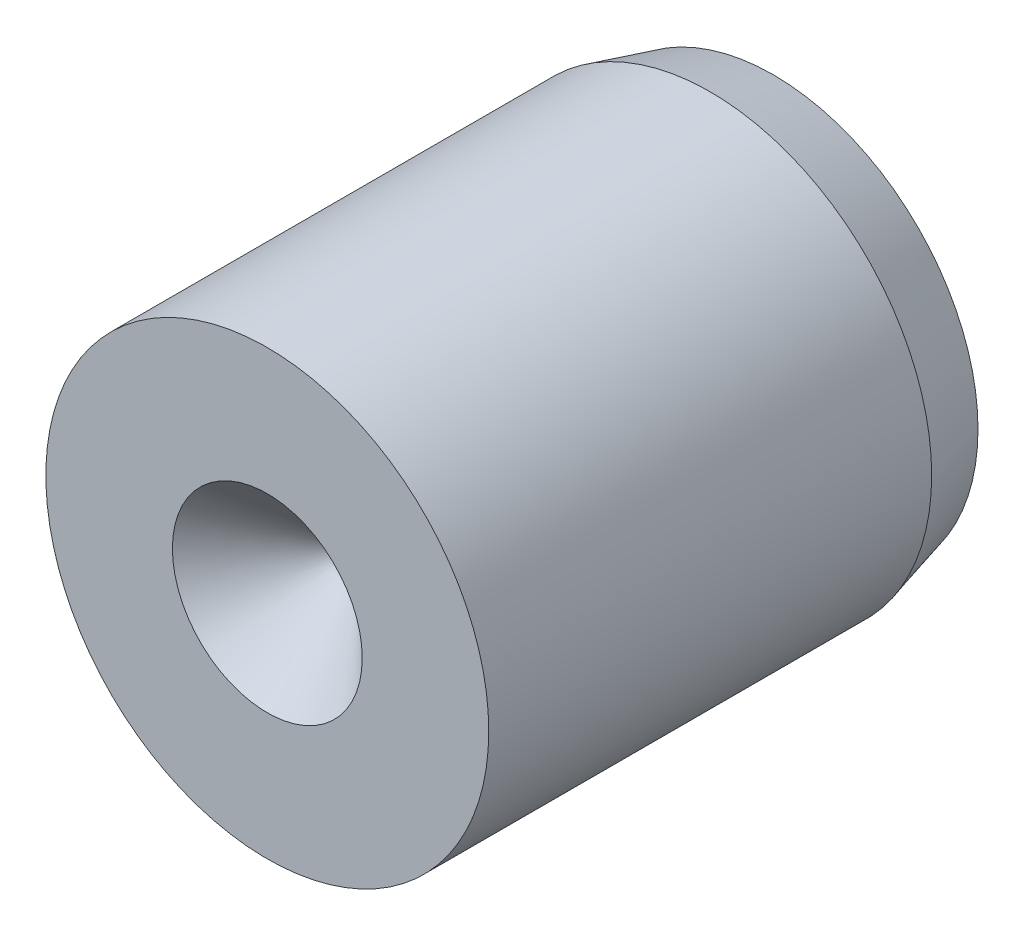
ISO-10303-21;
HEADER;
FILE_DESCRIPTION(('STEP AP214'),'2;1');
FILE_NAME('part.step','',(''),(''),'','','');
FILE_SCHEMA(('AUTOMOTIVE_DESIGN { 1 0 10303 214 1 1 1 1 }'));
ENDSEC;
DATA;
#1=APPLICATION_CONTEXT('core data for automotive mechanical design processes');
#2=APPLICATION_PROTOCOL_DEFINITION('international standard','automotive_design',2000,#1);
#3=PRODUCT_CONTEXT('',#1,'mechanical');
#4=PRODUCT('Part','Part','',(#3));
#5=PRODUCT_RELATED_PRODUCT_CATEGORY('part','',(#4));
#6=PRODUCT_DEFINITION_FORMATION('','',#4);
#7=PRODUCT_DEFINITION_CONTEXT('part definition',#1,'design');
#8=PRODUCT_DEFINITION('design','',#6,#7);
#9=PRODUCT_DEFINITION_SHAPE('','',#8);
#10=(LENGTH_UNIT() NAMED_UNIT(*) SI_UNIT(.MILLI.,.METRE.));
#11=(NAMED_UNIT(*) PLANE_ANGLE_UNIT() SI_UNIT($,.RADIAN.));
#12=(NAMED_UNIT(*) SI_UNIT($,.STERADIAN.) SOLID_ANGLE_UNIT());
#13=UNCERTAINTY_MEASURE_WITH_UNIT(LENGTH_MEASURE(1.E-05),#10,'distance_accuracy_value','');
#14=(GEOMETRIC_REPRESENTATION_CONTEXT(3) GLOBAL_UNCERTAINTY_ASSIGNED_CONTEXT((#13)) GLOBAL_UNIT_ASSIGNED_CONTEXT((#10,
#11,#12)) REPRESENTATION_CONTEXT('',''));
#15=CARTESIAN_POINT('',(0.,0.,0.));
#16=DIRECTION('',(0.,0.,1.));
#17=DIRECTION('',(1.,0.,0.));
#18=AXIS2_PLACEMENT_3D('',#15,#16,#17);
#19=CARTESIAN_POINT('',(0.,7.,16.));
#20=DIRECTION('',(0.,0.,-1.));
#21=DIRECTION('',(-1.,0.,0.));
#22=AXIS2_PLACEMENT_3D('',#19,#20,#21);
#23=PLANE('',#22);
#24=CARTESIAN_POINT('',(0.,0.,16.));
#25=DIRECTION('',(0.,0.,1.));
#26=DIRECTION('',(1.,0.,0.));
#27=AXIS2_PLACEMENT_3D('',#24,#25,#26);
#28=CIRCLE('',#27,3.);
#29=CARTESIAN_POINT('',(3.,0.,16.));
#30=VERTEX_POINT('',#29);
#31=EDGE_CURVE('E9',#30,#30,#28,.T.);
#32=ORIENTED_EDGE('',*,*,#31,.F.);
#33=EDGE_LOOP('',(#32));
#34=FACE_BOUND('',#33,.T.);
#35=CARTESIAN_POINT('',(0.,0.,16.));
#36=DIRECTION('',(0.,0.,1.));
#37=DIRECTION('',(1.,0.,0.));
#38=AXIS2_PLACEMENT_3D('',#35,#36,#37);
#39=CIRCLE('',#38,7.);
#40=CARTESIAN_POINT('',(7.,0.,16.));
#41=VERTEX_POINT('',#40);
#42=EDGE_CURVE('E33',#41,#41,#39,.T.);
#43=ORIENTED_EDGE('',*,*,#42,.T.);
#44=EDGE_LOOP('',(#43));
#45=FACE_BOUND('',#44,.T.);
#46=ADVANCED_FACE('F14',(#34,#45),#23,.F.);
#47=CARTESIAN_POINT('',(0.,0.,16.));
#48=DIRECTION('',(0.,0.,1.));
#49=DIRECTION('',(1.,0.,0.));
#50=AXIS2_PLACEMENT_3D('',#47,#48,#49);
#51=CONICAL_SURFACE('',#50,3.,0.78539816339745);
#52=CARTESIAN_POINT('',(0.,0.,13.));
#53=VERTEX_POINT('',#52);
#54=VERTEX_LOOP('',#53);
#55=FACE_BOUND('',#54,.T.);
#56=ORIENTED_EDGE('',*,*,#31,.T.);
#57=EDGE_LOOP('',(#56));
#58=FACE_BOUND('',#57,.T.);
#59=ADVANCED_FACE('F23',(#55,#58),#51,.F.);
#60=CARTESIAN_POINT('',(0.,6.46410161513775,0.));
#61=DIRECTION('',(0.,0.,-1.));
#62=DIRECTION('',(-1.,0.,0.));
#63=AXIS2_PLACEMENT_3D('',#60,#61,#62);
#64=PLANE('',#63);
#65=CARTESIAN_POINT('',(0.,0.,0.));
#66=DIRECTION('',(0.,0.,1.));
#67=DIRECTION('',(1.,0.,0.));
#68=AXIS2_PLACEMENT_3D('',#65,#66,#67);
#69=CIRCLE('',#68,6.46410161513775);
#70=CARTESIAN_POINT('',(6.46410161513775,0.,0.));
#71=VERTEX_POINT('',#70);
#72=EDGE_CURVE('E20',#71,#71,#69,.T.);
#73=ORIENTED_EDGE('',*,*,#72,.F.);
#74=EDGE_LOOP('',(#73));
#75=FACE_BOUND('',#74,.T.);
#76=ADVANCED_FACE('F26',(#75),#64,.T.);
#77=CARTESIAN_POINT('',(0.,0.,2.));
#78=DIRECTION('',(0.,0.,1.));
#79=DIRECTION('',(1.,0.,0.));
#80=AXIS2_PLACEMENT_3D('',#77,#78,#79);
#81=CONICAL_SURFACE('',#80,7.,0.26179938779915);
#82=ORIENTED_EDGE('',*,*,#72,.T.);
#83=EDGE_LOOP('',(#82));
#84=FACE_BOUND('',#83,.T.);
#85=CARTESIAN_POINT('',(0.,0.,2.));
#86=DIRECTION('',(0.,0.,1.));
#87=DIRECTION('',(1.,0.,0.));
#88=AXIS2_PLACEMENT_3D('',#85,#86,#87);
#89=CIRCLE('',#88,7.);
#90=CARTESIAN_POINT('',(7.,0.,2.));
#91=VERTEX_POINT('',#90);
#92=EDGE_CURVE('E35',#91,#91,#89,.T.);
#93=ORIENTED_EDGE('',*,*,#92,.F.);
#94=EDGE_LOOP('',(#93));
#95=FACE_BOUND('',#94,.T.);
#96=ADVANCED_FACE('F42',(#84,#95),#81,.T.);
#97=CARTESIAN_POINT('',(0.,0.,7.));
#98=DIRECTION('',(0.,0.,1.));
#99=DIRECTION('',(1.,0.,0.));
#100=AXIS2_PLACEMENT_3D('',#97,#98,#99);
#101=CYLINDRICAL_SURFACE('',#100,7.);
#102=ORIENTED_EDGE('',*,*,#92,.T.);
#103=EDGE_LOOP('',(#102));
#104=FACE_BOUND('',#103,.T.);
#105=ORIENTED_EDGE('',*,*,#42,.F.);
#106=EDGE_LOOP('',(#105));
#107=FACE_BOUND('',#106,.T.);
#108=ADVANCED_FACE('F51',(#104,#107),#101,.T.);
#109=CLOSED_SHELL('',(#46,#59,#76,#96,#108));
#110=MANIFOLD_SOLID_BREP('B1',#109);
#111=ADVANCED_BREP_SHAPE_REPRESENTATION('',(#18,#110),#14);
#112=SHAPE_DEFINITION_REPRESENTATION(#9,#111);
ENDSEC;
END-ISO-10303-21;
